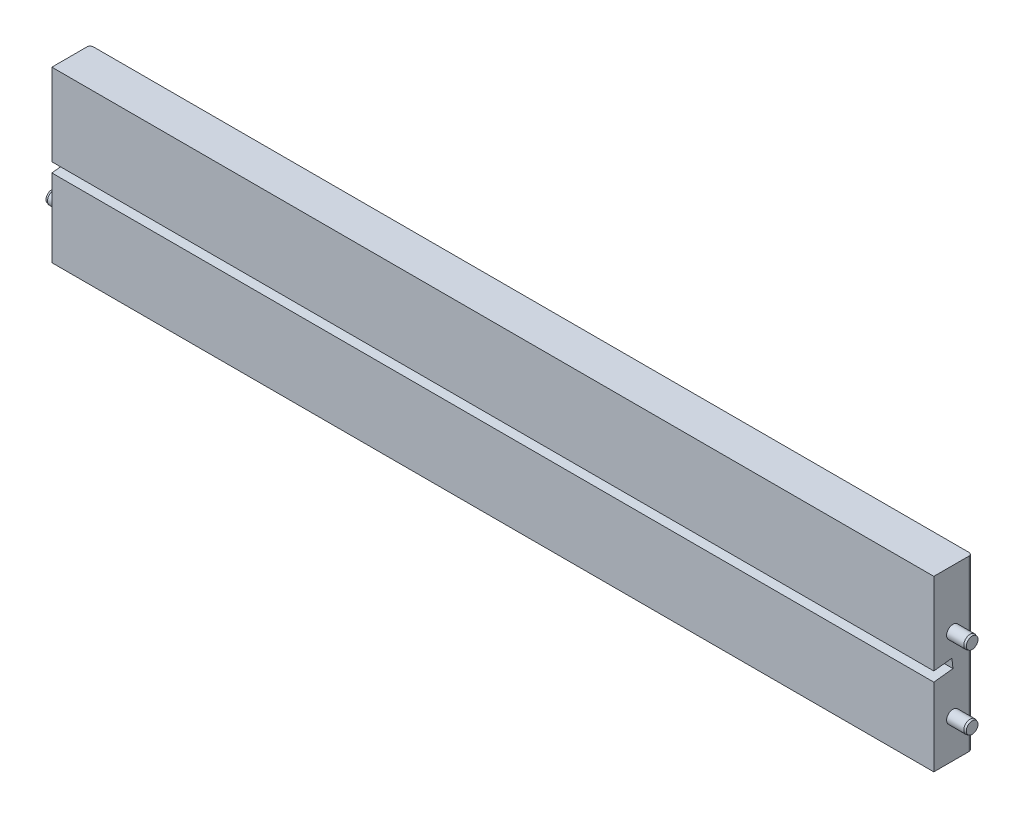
ISO-10303-21;
HEADER;
FILE_DESCRIPTION(('STEP AP214'),'2;1');
FILE_NAME('part.step','',(''),(''),'','','');
FILE_SCHEMA(('AUTOMOTIVE_DESIGN { 1 0 10303 214 1 1 1 1 }'));
ENDSEC;
DATA;
#1=APPLICATION_CONTEXT('core data for automotive mechanical design processes');
#2=APPLICATION_PROTOCOL_DEFINITION('international standard','automotive_design',2000,#1);
#3=PRODUCT_CONTEXT('',#1,'mechanical');
#4=PRODUCT('Part','Part','',(#3));
#5=PRODUCT_RELATED_PRODUCT_CATEGORY('part','',(#4));
#6=PRODUCT_DEFINITION_FORMATION('','',#4);
#7=PRODUCT_DEFINITION_CONTEXT('part definition',#1,'design');
#8=PRODUCT_DEFINITION('design','',#6,#7);
#9=PRODUCT_DEFINITION_SHAPE('','',#8);
#10=(LENGTH_UNIT() NAMED_UNIT(*) SI_UNIT(.MILLI.,.METRE.));
#11=(NAMED_UNIT(*) PLANE_ANGLE_UNIT() SI_UNIT($,.RADIAN.));
#12=(NAMED_UNIT(*) SI_UNIT($,.STERADIAN.) SOLID_ANGLE_UNIT());
#13=UNCERTAINTY_MEASURE_WITH_UNIT(LENGTH_MEASURE(1.E-05),#10,'distance_accuracy_value','');
#14=(GEOMETRIC_REPRESENTATION_CONTEXT(3) GLOBAL_UNCERTAINTY_ASSIGNED_CONTEXT((#13)) GLOBAL_UNIT_ASSIGNED_CONTEXT((#10,
#11,#12)) REPRESENTATION_CONTEXT('',''));
#15=CARTESIAN_POINT('',(0.,0.,0.));
#16=DIRECTION('',(0.,0.,1.));
#17=DIRECTION('',(1.,0.,0.));
#18=AXIS2_PLACEMENT_3D('',#15,#16,#17);
#19=CARTESIAN_POINT('',(-234.,25.8311920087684,-98.9999999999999));
#20=DIRECTION('',(1.,0.,0.));
#21=DIRECTION('',(0.,0.,-1.));
#22=AXIS2_PLACEMENT_3D('',#19,#20,#21);
#23=PLANE('',#22);
#24=CARTESIAN_POINT('',(-234.,24.,-98.9999999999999));
#25=DIRECTION('',(-1.,0.,0.));
#26=DIRECTION('',(0.,0.,1.));
#27=AXIS2_PLACEMENT_3D('',#24,#25,#26);
#28=CIRCLE('',#27,1.8311920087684);
#29=CARTESIAN_POINT('',(-234.,24.,-97.1688079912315));
#30=VERTEX_POINT('',#29);
#31=EDGE_CURVE('E57',#30,#30,#28,.T.);
#32=ORIENTED_EDGE('',*,*,#31,.T.);
#33=EDGE_LOOP('',(#32));
#34=FACE_BOUND('',#33,.T.);
#35=ADVANCED_FACE('F43',(#34),#23,.F.);
#36=CARTESIAN_POINT('',(-214.,24.,-98.9999999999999));
#37=DIRECTION('',(-1.,0.,0.));
#38=DIRECTION('',(0.,0.,1.));
#39=AXIS2_PLACEMENT_3D('',#36,#37,#38);
#40=PLANE('',#39);
#41=CARTESIAN_POINT('',(-214.,24.,-98.9999999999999));
#42=DIRECTION('',(-1.,0.,0.));
#43=DIRECTION('',(0.,0.,1.));
#44=AXIS2_PLACEMENT_3D('',#41,#42,#43);
#45=CIRCLE('',#44,1.8311920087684);
#46=CARTESIAN_POINT('',(-214.,24.,-97.1688079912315));
#47=VERTEX_POINT('',#46);
#48=EDGE_CURVE('E11',#47,#47,#45,.T.);
#49=ORIENTED_EDGE('',*,*,#48,.F.);
#50=EDGE_LOOP('',(#49));
#51=FACE_BOUND('',#50,.T.);
#52=ADVANCED_FACE('F77',(#51),#40,.F.);
#53=CARTESIAN_POINT('',(-214.,24.,-98.9999999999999));
#54=DIRECTION('',(-1.,0.,0.));
#55=DIRECTION('',(0.,0.,1.));
#56=AXIS2_PLACEMENT_3D('',#53,#54,#55);
#57=CONICAL_SURFACE('',#56,1.8311920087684,0.261799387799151);
#58=CARTESIAN_POINT('',(-214.63,24.,-98.9999999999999));
#59=DIRECTION('',(-1.,0.,0.));
#60=DIRECTION('',(0.,0.,1.));
#61=AXIS2_PLACEMENT_3D('',#58,#59,#60);
#62=CIRCLE('',#61,2.);
#63=CARTESIAN_POINT('',(-214.63,24.,-96.9999999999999));
#64=VERTEX_POINT('',#63);
#65=EDGE_CURVE('E49',#64,#64,#62,.T.);
#66=ORIENTED_EDGE('',*,*,#65,.F.);
#67=EDGE_LOOP('',(#66));
#68=FACE_BOUND('',#67,.T.);
#69=ORIENTED_EDGE('',*,*,#48,.T.);
#70=EDGE_LOOP('',(#69));
#71=FACE_BOUND('',#70,.T.);
#72=ADVANCED_FACE('F72',(#68,#71),#57,.T.);
#73=CARTESIAN_POINT('',(-240.35,24.,-98.9999999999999));
#74=DIRECTION('',(-1.,0.,0.));
#75=DIRECTION('',(0.,0.,1.));
#76=AXIS2_PLACEMENT_3D('',#73,#74,#75);
#77=CYLINDRICAL_SURFACE('',#76,2.);
#78=CARTESIAN_POINT('',(-233.37,24.,-98.9999999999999));
#79=DIRECTION('',(-1.,0.,0.));
#80=DIRECTION('',(0.,0.,1.));
#81=AXIS2_PLACEMENT_3D('',#78,#79,#80);
#82=CIRCLE('',#81,2.);
#83=CARTESIAN_POINT('',(-233.37,24.,-96.9999999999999));
#84=VERTEX_POINT('',#83);
#85=EDGE_CURVE('E53',#84,#84,#82,.T.);
#86=ORIENTED_EDGE('',*,*,#85,.F.);
#87=EDGE_LOOP('',(#86));
#88=FACE_BOUND('',#87,.T.);
#89=ORIENTED_EDGE('',*,*,#65,.T.);
#90=EDGE_LOOP('',(#89));
#91=FACE_BOUND('',#90,.T.);
#92=ADVANCED_FACE('F67',(#88,#91),#77,.T.);
#93=CARTESIAN_POINT('',(-233.37,24.,-98.9999999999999));
#94=DIRECTION('',(1.,0.,0.));
#95=DIRECTION('',(0.,0.,-1.));
#96=AXIS2_PLACEMENT_3D('',#93,#94,#95);
#97=CONICAL_SURFACE('',#96,2.,0.261799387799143);
#98=ORIENTED_EDGE('',*,*,#31,.F.);
#99=EDGE_LOOP('',(#98));
#100=FACE_BOUND('',#99,.T.);
#101=ORIENTED_EDGE('',*,*,#85,.T.);
#102=EDGE_LOOP('',(#101));
#103=FACE_BOUND('',#102,.T.);
#104=ADVANCED_FACE('F64',(#100,#103),#97,.T.);
#105=CLOSED_SHELL('',(#35,#52,#72,#92,#104));
#106=MANIFOLD_SOLID_BREP('B2',#105);
#107=CARTESIAN_POINT('',(34.,48.8311920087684,-98.9999999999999));
#108=DIRECTION('',(1.,0.,0.));
#109=DIRECTION('',(0.,0.,-1.));
#110=AXIS2_PLACEMENT_3D('',#107,#108,#109);
#111=PLANE('',#110);
#112=CARTESIAN_POINT('',(34.,47.,-98.9999999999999));
#113=DIRECTION('',(-1.,0.,0.));
#114=DIRECTION('',(0.,0.,1.));
#115=AXIS2_PLACEMENT_3D('',#112,#113,#114);
#116=CIRCLE('',#115,1.8311920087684);
#117=CARTESIAN_POINT('',(34.,47.,-97.1688079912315));
#118=VERTEX_POINT('',#117);
#119=EDGE_CURVE('E135',#118,#118,#116,.T.);
#120=ORIENTED_EDGE('',*,*,#119,.T.);
#121=EDGE_LOOP('',(#120));
#122=FACE_BOUND('',#121,.T.);
#123=ADVANCED_FACE('F121',(#122),#111,.F.);
#124=CARTESIAN_POINT('',(54.,47.,-98.9999999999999));
#125=DIRECTION('',(-1.,0.,0.));
#126=DIRECTION('',(0.,0.,1.));
#127=AXIS2_PLACEMENT_3D('',#124,#125,#126);
#128=PLANE('',#127);
#129=CARTESIAN_POINT('',(54.,47.,-98.9999999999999));
#130=DIRECTION('',(-1.,0.,0.));
#131=DIRECTION('',(0.,0.,1.));
#132=AXIS2_PLACEMENT_3D('',#129,#130,#131);
#133=CIRCLE('',#132,1.8311920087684);
#134=CARTESIAN_POINT('',(54.,47.,-97.1688079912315));
#135=VERTEX_POINT('',#134);
#136=EDGE_CURVE('E42',#135,#135,#133,.T.);
#137=ORIENTED_EDGE('',*,*,#136,.F.);
#138=EDGE_LOOP('',(#137));
#139=FACE_BOUND('',#138,.T.);
#140=ADVANCED_FACE('F155',(#139),#128,.F.);
#141=CARTESIAN_POINT('',(54.,47.,-98.9999999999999));
#142=DIRECTION('',(-1.,0.,0.));
#143=DIRECTION('',(0.,0.,1.));
#144=AXIS2_PLACEMENT_3D('',#141,#142,#143);
#145=CONICAL_SURFACE('',#144,1.8311920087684,0.261799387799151);
#146=CARTESIAN_POINT('',(53.37,47.,-98.9999999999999));
#147=DIRECTION('',(-1.,0.,0.));
#148=DIRECTION('',(0.,0.,1.));
#149=AXIS2_PLACEMENT_3D('',#146,#147,#148);
#150=CIRCLE('',#149,2.);
#151=CARTESIAN_POINT('',(53.37,47.,-96.9999999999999));
#152=VERTEX_POINT('',#151);
#153=EDGE_CURVE('E127',#152,#152,#150,.T.);
#154=ORIENTED_EDGE('',*,*,#153,.F.);
#155=EDGE_LOOP('',(#154));
#156=FACE_BOUND('',#155,.T.);
#157=ORIENTED_EDGE('',*,*,#136,.T.);
#158=EDGE_LOOP('',(#157));
#159=FACE_BOUND('',#158,.T.);
#160=ADVANCED_FACE('F150',(#156,#159),#145,.T.);
#161=CARTESIAN_POINT('',(27.65,47.,-98.9999999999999));
#162=DIRECTION('',(-1.,0.,0.));
#163=DIRECTION('',(0.,0.,1.));
#164=AXIS2_PLACEMENT_3D('',#161,#162,#163);
#165=CYLINDRICAL_SURFACE('',#164,2.);
#166=CARTESIAN_POINT('',(34.63,47.,-98.9999999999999));
#167=DIRECTION('',(-1.,0.,0.));
#168=DIRECTION('',(0.,0.,1.));
#169=AXIS2_PLACEMENT_3D('',#166,#167,#168);
#170=CIRCLE('',#169,2.);
#171=CARTESIAN_POINT('',(34.63,47.,-96.9999999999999));
#172=VERTEX_POINT('',#171);
#173=EDGE_CURVE('E131',#172,#172,#170,.T.);
#174=ORIENTED_EDGE('',*,*,#173,.F.);
#175=EDGE_LOOP('',(#174));
#176=FACE_BOUND('',#175,.T.);
#177=ORIENTED_EDGE('',*,*,#153,.T.);
#178=EDGE_LOOP('',(#177));
#179=FACE_BOUND('',#178,.T.);
#180=ADVANCED_FACE('F145',(#176,#179),#165,.T.);
#181=CARTESIAN_POINT('',(34.63,47.,-98.9999999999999));
#182=DIRECTION('',(1.,0.,0.));
#183=DIRECTION('',(0.,0.,-1.));
#184=AXIS2_PLACEMENT_3D('',#181,#182,#183);
#185=CONICAL_SURFACE('',#184,2.,0.261799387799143);
#186=ORIENTED_EDGE('',*,*,#119,.F.);
#187=EDGE_LOOP('',(#186));
#188=FACE_BOUND('',#187,.T.);
#189=ORIENTED_EDGE('',*,*,#173,.T.);
#190=EDGE_LOOP('',(#189));
#191=FACE_BOUND('',#190,.T.);
#192=ADVANCED_FACE('F142',(#188,#191),#185,.T.);
#193=CLOSED_SHELL('',(#123,#140,#160,#180,#192));
#194=MANIFOLD_SOLID_BREP('B6',#193);
#195=CARTESIAN_POINT('',(34.,25.8311920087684,-98.9999999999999));
#196=DIRECTION('',(1.,0.,0.));
#197=DIRECTION('',(0.,0.,-1.));
#198=AXIS2_PLACEMENT_3D('',#195,#196,#197);
#199=PLANE('',#198);
#200=CARTESIAN_POINT('',(34.,24.,-98.9999999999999));
#201=DIRECTION('',(-1.,0.,0.));
#202=DIRECTION('',(0.,0.,1.));
#203=AXIS2_PLACEMENT_3D('',#200,#201,#202);
#204=CIRCLE('',#203,1.8311920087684);
#205=CARTESIAN_POINT('',(34.,24.,-97.1688079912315));
#206=VERTEX_POINT('',#205);
#207=EDGE_CURVE('E214',#206,#206,#204,.T.);
#208=ORIENTED_EDGE('',*,*,#207,.T.);
#209=EDGE_LOOP('',(#208));
#210=FACE_BOUND('',#209,.T.);
#211=ADVANCED_FACE('F200',(#210),#199,.F.);
#212=CARTESIAN_POINT('',(54.,24.,-98.9999999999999));
#213=DIRECTION('',(-1.,0.,0.));
#214=DIRECTION('',(0.,0.,1.));
#215=AXIS2_PLACEMENT_3D('',#212,#213,#214);
#216=PLANE('',#215);
#217=CARTESIAN_POINT('',(54.,24.,-98.9999999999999));
#218=DIRECTION('',(-1.,0.,0.));
#219=DIRECTION('',(0.,0.,1.));
#220=AXIS2_PLACEMENT_3D('',#217,#218,#219);
#221=CIRCLE('',#220,1.8311920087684);
#222=CARTESIAN_POINT('',(54.,24.,-97.1688079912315));
#223=VERTEX_POINT('',#222);
#224=EDGE_CURVE('E120',#223,#223,#221,.T.);
#225=ORIENTED_EDGE('',*,*,#224,.F.);
#226=EDGE_LOOP('',(#225));
#227=FACE_BOUND('',#226,.T.);
#228=ADVANCED_FACE('F234',(#227),#216,.F.);
#229=CARTESIAN_POINT('',(54.,24.,-98.9999999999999));
#230=DIRECTION('',(-1.,0.,0.));
#231=DIRECTION('',(0.,0.,1.));
#232=AXIS2_PLACEMENT_3D('',#229,#230,#231);
#233=CONICAL_SURFACE('',#232,1.8311920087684,0.261799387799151);
#234=CARTESIAN_POINT('',(53.37,24.,-98.9999999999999));
#235=DIRECTION('',(-1.,0.,0.));
#236=DIRECTION('',(0.,0.,1.));
#237=AXIS2_PLACEMENT_3D('',#234,#235,#236);
#238=CIRCLE('',#237,2.);
#239=CARTESIAN_POINT('',(53.37,24.,-96.9999999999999));
#240=VERTEX_POINT('',#239);
#241=EDGE_CURVE('E206',#240,#240,#238,.T.);
#242=ORIENTED_EDGE('',*,*,#241,.F.);
#243=EDGE_LOOP('',(#242));
#244=FACE_BOUND('',#243,.T.);
#245=ORIENTED_EDGE('',*,*,#224,.T.);
#246=EDGE_LOOP('',(#245));
#247=FACE_BOUND('',#246,.T.);
#248=ADVANCED_FACE('F229',(#244,#247),#233,.T.);
#249=CARTESIAN_POINT('',(27.65,24.,-98.9999999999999));
#250=DIRECTION('',(-1.,0.,0.));
#251=DIRECTION('',(0.,0.,1.));
#252=AXIS2_PLACEMENT_3D('',#249,#250,#251);
#253=CYLINDRICAL_SURFACE('',#252,2.);
#254=CARTESIAN_POINT('',(34.63,24.,-98.9999999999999));
#255=DIRECTION('',(-1.,0.,0.));
#256=DIRECTION('',(0.,0.,1.));
#257=AXIS2_PLACEMENT_3D('',#254,#255,#256);
#258=CIRCLE('',#257,2.);
#259=CARTESIAN_POINT('',(34.63,24.,-96.9999999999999));
#260=VERTEX_POINT('',#259);
#261=EDGE_CURVE('E210',#260,#260,#258,.T.);
#262=ORIENTED_EDGE('',*,*,#261,.F.);
#263=EDGE_LOOP('',(#262));
#264=FACE_BOUND('',#263,.T.);
#265=ORIENTED_EDGE('',*,*,#241,.T.);
#266=EDGE_LOOP('',(#265));
#267=FACE_BOUND('',#266,.T.);
#268=ADVANCED_FACE('F224',(#264,#267),#253,.T.);
#269=CARTESIAN_POINT('',(34.63,24.,-98.9999999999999));
#270=DIRECTION('',(1.,0.,0.));
#271=DIRECTION('',(0.,0.,-1.));
#272=AXIS2_PLACEMENT_3D('',#269,#270,#271);
#273=CONICAL_SURFACE('',#272,2.,0.261799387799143);
#274=ORIENTED_EDGE('',*,*,#207,.F.);
#275=EDGE_LOOP('',(#274));
#276=FACE_BOUND('',#275,.T.);
#277=ORIENTED_EDGE('',*,*,#261,.T.);
#278=EDGE_LOOP('',(#277));
#279=FACE_BOUND('',#278,.T.);
#280=ADVANCED_FACE('F221',(#276,#279),#273,.T.);
#281=CLOSED_SHELL('',(#211,#228,#248,#268,#280));
#282=MANIFOLD_SOLID_BREP('B37',#281);
#283=CARTESIAN_POINT('',(48.,65.,-93.));
#284=DIRECTION('',(1.,0.,0.));
#285=DIRECTION('',(0.,0.,-1.));
#286=AXIS2_PLACEMENT_3D('',#283,#284,#285);
#287=PLANE('',#286);
#288=CARTESIAN_POINT('',(48.,47.,-98.9999999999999));
#289=DIRECTION('',(1.,0.,0.));
#290=DIRECTION('',(0.,0.,-1.));
#291=AXIS2_PLACEMENT_3D('',#288,#289,#290);
#292=CIRCLE('',#291,2.);
#293=CARTESIAN_POINT('',(48.,47.,-101.));
#294=VERTEX_POINT('',#293);
#295=EDGE_CURVE('E623',#294,#294,#292,.T.);
#296=ORIENTED_EDGE('',*,*,#295,.F.);
#297=EDGE_LOOP('',(#296));
#298=FACE_BOUND('',#297,.T.);
#299=CARTESIAN_POINT('',(48.,24.,-98.9999999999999));
#300=DIRECTION('',(1.,0.,0.));
#301=DIRECTION('',(0.,0.,-1.));
#302=AXIS2_PLACEMENT_3D('',#299,#300,#301);
#303=CIRCLE('',#302,2.);
#304=CARTESIAN_POINT('',(48.,24.,-101.));
#305=VERTEX_POINT('',#304);
#306=EDGE_CURVE('E367',#305,#305,#303,.T.);
#307=ORIENTED_EDGE('',*,*,#306,.F.);
#308=EDGE_LOOP('',(#307));
#309=FACE_BOUND('',#308,.T.);
#310=DIRECTION('',(0.,0.,-1.));
#311=VECTOR('',#310,1.);
#312=CARTESIAN_POINT('',(48.,12.,-93.));
#313=LINE('',#312,#311);
#314=CARTESIAN_POINT('',(48.,12.,-93.));
#315=VERTEX_POINT('',#314);
#316=CARTESIAN_POINT('',(48.,12.,-104.));
#317=VERTEX_POINT('',#316);
#318=EDGE_CURVE('E409',#315,#317,#313,.T.);
#319=ORIENTED_EDGE('',*,*,#318,.T.);
#320=DIRECTION('',(0.,-1.,0.));
#321=VECTOR('',#320,1.);
#322=CARTESIAN_POINT('',(48.,65.,-104.));
#323=LINE('',#322,#321);
#324=CARTESIAN_POINT('',(48.,65.,-104.));
#325=VERTEX_POINT('',#324);
#326=EDGE_CURVE('E198',#317,#325,#323,.F.);
#327=ORIENTED_EDGE('',*,*,#326,.T.);
#328=DIRECTION('',(0.,0.,-1.));
#329=VECTOR('',#328,1.);
#330=CARTESIAN_POINT('',(48.,65.,-93.));
#331=LINE('',#330,#329);
#332=CARTESIAN_POINT('',(48.,65.,-93.));
#333=VERTEX_POINT('',#332);
#334=EDGE_CURVE('E412',#333,#325,#331,.T.);
#335=ORIENTED_EDGE('',*,*,#334,.F.);
#336=DIRECTION('',(0.,-1.,0.));
#337=VECTOR('',#336,1.);
#338=CARTESIAN_POINT('',(48.,65.,-93.));
#339=LINE('',#338,#337);
#340=CARTESIAN_POINT('',(48.,39.3517950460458,-93.));
#341=VERTEX_POINT('',#340);
#342=EDGE_CURVE('E401',#333,#341,#339,.T.);
#343=ORIENTED_EDGE('',*,*,#342,.T.);
#344=DIRECTION('',(0.,-0.110431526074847,0.993883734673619));
#345=VECTOR('',#344,1.);
#346=CARTESIAN_POINT('',(48.,39.6645780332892,-95.8150468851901));
#347=LINE('',#346,#345);
#348=CARTESIAN_POINT('',(48.,39.9816512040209,-98.6687054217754));
#349=VERTEX_POINT('',#348);
#350=EDGE_CURVE('E378',#349,#341,#347,.T.);
#351=ORIENTED_EDGE('',*,*,#350,.F.);
#352=DIRECTION('',(0.,0.993883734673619,0.110431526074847));
#353=VECTOR('',#352,1.);
#354=CARTESIAN_POINT('',(48.,65.3170731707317,-95.8536585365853));
#355=LINE('',#354,#353);
#356=CARTESIAN_POINT('',(48.,37.,-98.9999999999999));
#357=VERTEX_POINT('',#356);
#358=EDGE_CURVE('E386',#357,#349,#355,.T.);
#359=ORIENTED_EDGE('',*,*,#358,.F.);
#360=DIRECTION('',(0.,-0.110431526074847,0.993883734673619));
#361=VECTOR('',#360,1.);
#362=CARTESIAN_POINT('',(48.,36.6829268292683,-96.1463414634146));
#363=LINE('',#362,#361);
#364=CARTESIAN_POINT('',(48.,36.3333333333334,-93.));
#365=VERTEX_POINT('',#364);
#366=EDGE_CURVE('E383',#357,#365,#363,.T.);
#367=ORIENTED_EDGE('',*,*,#366,.T.);
#368=EDGE_CURVE('E400',#365,#315,#339,.T.);
#369=ORIENTED_EDGE('',*,*,#368,.T.);
#370=EDGE_LOOP('',(#319,#327,#335,#343,#351,#359,#367,#369));
#371=FACE_BOUND('',#370,.T.);
#372=ADVANCED_FACE('F271',(#298,#309,#371),#287,.T.);
#373=CARTESIAN_POINT('',(-228.,12.,-92.9999999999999));
#374=DIRECTION('',(-1.,0.,0.));
#375=DIRECTION('',(0.,0.,1.));
#376=AXIS2_PLACEMENT_3D('',#373,#374,#375);
#377=PLANE('',#376);
#378=CARTESIAN_POINT('',(-228.,24.,-98.9999999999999));
#379=DIRECTION('',(-1.,0.,0.));
#380=DIRECTION('',(0.,0.,1.));
#381=AXIS2_PLACEMENT_3D('',#378,#379,#380);
#382=CIRCLE('',#381,1.99999999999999);
#383=CARTESIAN_POINT('',(-228.,24.,-96.9999999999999));
#384=VERTEX_POINT('',#383);
#385=EDGE_CURVE('E621',#384,#384,#382,.T.);
#386=ORIENTED_EDGE('',*,*,#385,.F.);
#387=EDGE_LOOP('',(#386));
#388=FACE_BOUND('',#387,.T.);
#389=CARTESIAN_POINT('',(-228.,47.,-98.9999999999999));
#390=DIRECTION('',(-1.,0.,0.));
#391=DIRECTION('',(0.,0.,1.));
#392=AXIS2_PLACEMENT_3D('',#389,#390,#391);
#393=CIRCLE('',#392,2.25);
#394=CARTESIAN_POINT('',(-228.,47.,-96.7499999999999));
#395=VERTEX_POINT('',#394);
#396=EDGE_CURVE('E360',#395,#395,#393,.T.);
#397=ORIENTED_EDGE('',*,*,#396,.F.);
#398=EDGE_LOOP('',(#397));
#399=FACE_BOUND('',#398,.T.);
#400=DIRECTION('',(0.,0.,-1.));
#401=VECTOR('',#400,1.);
#402=CARTESIAN_POINT('',(-228.,65.,-92.9999999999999));
#403=LINE('',#402,#401);
#404=CARTESIAN_POINT('',(-228.,65.,-92.9999999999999));
#405=VERTEX_POINT('',#404);
#406=CARTESIAN_POINT('',(-228.,65.,-104.));
#407=VERTEX_POINT('',#406);
#408=EDGE_CURVE('E415',#405,#407,#403,.T.);
#409=ORIENTED_EDGE('',*,*,#408,.T.);
#410=DIRECTION('',(0.,1.,0.));
#411=VECTOR('',#410,1.);
#412=CARTESIAN_POINT('',(-228.,12.,-104.));
#413=LINE('',#412,#411);
#414=CARTESIAN_POINT('',(-228.,12.,-104.));
#415=VERTEX_POINT('',#414);
#416=EDGE_CURVE('E294',#407,#415,#413,.F.);
#417=ORIENTED_EDGE('',*,*,#416,.T.);
#418=DIRECTION('',(0.,0.,-1.));
#419=VECTOR('',#418,1.);
#420=CARTESIAN_POINT('',(-228.,12.,-92.9999999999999));
#421=LINE('',#420,#419);
#422=CARTESIAN_POINT('',(-228.,12.,-92.9999999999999));
#423=VERTEX_POINT('',#422);
#424=EDGE_CURVE('E404',#423,#415,#421,.T.);
#425=ORIENTED_EDGE('',*,*,#424,.F.);
#426=DIRECTION('',(0.,1.,0.));
#427=VECTOR('',#426,1.);
#428=CARTESIAN_POINT('',(-228.,12.,-92.9999999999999));
#429=LINE('',#428,#427);
#430=CARTESIAN_POINT('',(-228.,36.3333333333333,-92.9999999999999));
#431=VERTEX_POINT('',#430);
#432=EDGE_CURVE('E394',#423,#431,#429,.T.);
#433=ORIENTED_EDGE('',*,*,#432,.T.);
#434=DIRECTION('',(0.,0.110431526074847,-0.993883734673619));
#435=VECTOR('',#434,1.);
#436=CARTESIAN_POINT('',(-228.,36.0365853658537,-90.3292682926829));
#437=LINE('',#436,#435);
#438=CARTESIAN_POINT('',(-228.,37.,-98.9999999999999));
#439=VERTEX_POINT('',#438);
#440=EDGE_CURVE('E380',#431,#439,#437,.T.);
#441=ORIENTED_EDGE('',*,*,#440,.T.);
#442=DIRECTION('',(0.,-0.993883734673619,-0.110431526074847));
#443=VECTOR('',#442,1.);
#444=CARTESIAN_POINT('',(-228.,12.9634146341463,-101.670731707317));
#445=LINE('',#444,#443);
#446=CARTESIAN_POINT('',(-228.,39.9816512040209,-98.6687054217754));
#447=VERTEX_POINT('',#446);
#448=EDGE_CURVE('E422',#447,#439,#445,.T.);
#449=ORIENTED_EDGE('',*,*,#448,.F.);
#450=DIRECTION('',(0.,0.110431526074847,-0.993883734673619));
#451=VECTOR('',#450,1.);
#452=CARTESIAN_POINT('',(-228.,39.0182365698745,-89.9979737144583));
#453=LINE('',#452,#451);
#454=CARTESIAN_POINT('',(-228.,39.3517950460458,-92.9999999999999));
#455=VERTEX_POINT('',#454);
#456=EDGE_CURVE('E374',#455,#447,#453,.T.);
#457=ORIENTED_EDGE('',*,*,#456,.F.);
#458=EDGE_CURVE('E392',#455,#405,#429,.T.);
#459=ORIENTED_EDGE('',*,*,#458,.T.);
#460=EDGE_LOOP('',(#409,#417,#425,#433,#441,#449,#457,#459));
#461=FACE_BOUND('',#460,.T.);
#462=ADVANCED_FACE('F448',(#388,#399,#461),#377,.T.);
#463=CARTESIAN_POINT('',(0.,0.,-93.));
#464=DIRECTION('',(0.,0.,-1.));
#465=DIRECTION('',(-1.,0.,0.));
#466=AXIS2_PLACEMENT_3D('',#463,#464,#465);
#467=PLANE('',#466);
#468=DIRECTION('',(1.,0.,0.));
#469=VECTOR('',#468,1.);
#470=CARTESIAN_POINT('',(0.,36.3333333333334,-93.));
#471=LINE('',#470,#469);
#472=EDGE_CURVE('E420',#431,#365,#471,.T.);
#473=ORIENTED_EDGE('',*,*,#472,.F.);
#474=ORIENTED_EDGE('',*,*,#432,.F.);
#475=DIRECTION('',(-1.,0.,0.));
#476=VECTOR('',#475,1.);
#477=CARTESIAN_POINT('',(48.,12.,-93.));
#478=LINE('',#477,#476);
#479=EDGE_CURVE('E389',#315,#423,#478,.T.);
#480=ORIENTED_EDGE('',*,*,#479,.F.);
#481=ORIENTED_EDGE('',*,*,#368,.F.);
#482=EDGE_LOOP('',(#473,#474,#480,#481));
#483=FACE_BOUND('',#482,.T.);
#484=ADVANCED_FACE('F464',(#483),#467,.F.);
#485=CARTESIAN_POINT('',(48.,12.,-93.));
#486=DIRECTION('',(0.,-1.,0.));
#487=DIRECTION('',(0.,0.,-1.));
#488=AXIS2_PLACEMENT_3D('',#485,#486,#487);
#489=PLANE('',#488);
#490=ORIENTED_EDGE('',*,*,#424,.T.);
#491=CARTESIAN_POINT('',(-227.,12.,-104.));
#492=DIRECTION('',(0.,-1.,0.));
#493=DIRECTION('',(0.,0.,-1.));
#494=AXIS2_PLACEMENT_3D('',#491,#492,#493);
#495=CIRCLE('',#494,1.);
#496=CARTESIAN_POINT('',(-227.,12.,-105.));
#497=VERTEX_POINT('',#496);
#498=EDGE_CURVE('E279',#415,#497,#495,.T.);
#499=ORIENTED_EDGE('',*,*,#498,.T.);
#500=DIRECTION('',(-1.,0.,0.));
#501=VECTOR('',#500,1.);
#502=CARTESIAN_POINT('',(48.,12.,-105.));
#503=LINE('',#502,#501);
#504=CARTESIAN_POINT('',(47.,12.,-105.));
#505=VERTEX_POINT('',#504);
#506=EDGE_CURVE('E388',#505,#497,#503,.T.);
#507=ORIENTED_EDGE('',*,*,#506,.F.);
#508=CARTESIAN_POINT('',(47.,12.,-104.));
#509=DIRECTION('',(0.,-1.,0.));
#510=DIRECTION('',(0.,0.,-1.));
#511=AXIS2_PLACEMENT_3D('',#508,#509,#510);
#512=CIRCLE('',#511,1.);
#513=EDGE_CURVE('E286',#505,#317,#512,.T.);
#514=ORIENTED_EDGE('',*,*,#513,.T.);
#515=ORIENTED_EDGE('',*,*,#318,.F.);
#516=ORIENTED_EDGE('',*,*,#479,.T.);
#517=EDGE_LOOP('',(#490,#499,#507,#514,#515,#516));
#518=FACE_BOUND('',#517,.T.);
#519=ADVANCED_FACE('F436',(#518),#489,.T.);
#520=CARTESIAN_POINT('',(-228.,65.,-92.9999999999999));
#521=DIRECTION('',(0.,1.,0.));
#522=DIRECTION('',(0.,0.,1.));
#523=AXIS2_PLACEMENT_3D('',#520,#521,#522);
#524=PLANE('',#523);
#525=DIRECTION('',(1.,0.,0.));
#526=VECTOR('',#525,1.);
#527=CARTESIAN_POINT('',(-228.,65.,-105.));
#528=LINE('',#527,#526);
#529=CARTESIAN_POINT('',(-227.,65.,-105.));
#530=VERTEX_POINT('',#529);
#531=CARTESIAN_POINT('',(47.,65.,-105.));
#532=VERTEX_POINT('',#531);
#533=EDGE_CURVE('E393',#530,#532,#528,.T.);
#534=ORIENTED_EDGE('',*,*,#533,.F.);
#535=CARTESIAN_POINT('',(-227.,65.,-104.));
#536=DIRECTION('',(0.,1.,0.));
#537=DIRECTION('',(0.,0.,1.));
#538=AXIS2_PLACEMENT_3D('',#535,#536,#537);
#539=CIRCLE('',#538,1.);
#540=EDGE_CURVE('E432',#530,#407,#539,.T.);
#541=ORIENTED_EDGE('',*,*,#540,.T.);
#542=ORIENTED_EDGE('',*,*,#408,.F.);
#543=DIRECTION('',(1.,0.,0.));
#544=VECTOR('',#543,1.);
#545=CARTESIAN_POINT('',(-228.,65.,-92.9999999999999));
#546=LINE('',#545,#544);
#547=EDGE_CURVE('E397',#405,#333,#546,.T.);
#548=ORIENTED_EDGE('',*,*,#547,.T.);
#549=ORIENTED_EDGE('',*,*,#334,.T.);
#550=CARTESIAN_POINT('',(47.,65.,-104.));
#551=DIRECTION('',(0.,1.,0.));
#552=DIRECTION('',(0.,0.,1.));
#553=AXIS2_PLACEMENT_3D('',#550,#551,#552);
#554=CIRCLE('',#553,1.);
#555=EDGE_CURVE('E430',#325,#532,#554,.T.);
#556=ORIENTED_EDGE('',*,*,#555,.T.);
#557=EDGE_LOOP('',(#534,#541,#542,#548,#549,#556));
#558=FACE_BOUND('',#557,.T.);
#559=ADVANCED_FACE('F446',(#558),#524,.T.);
#560=ORIENTED_EDGE('',*,*,#458,.F.);
#561=DIRECTION('',(1.,0.,0.));
#562=VECTOR('',#561,1.);
#563=CARTESIAN_POINT('',(0.,39.3517950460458,-93.));
#564=LINE('',#563,#562);
#565=EDGE_CURVE('E411',#455,#341,#564,.T.);
#566=ORIENTED_EDGE('',*,*,#565,.T.);
#567=ORIENTED_EDGE('',*,*,#342,.F.);
#568=ORIENTED_EDGE('',*,*,#547,.F.);
#569=EDGE_LOOP('',(#560,#566,#567,#568));
#570=FACE_BOUND('',#569,.T.);
#571=ADVANCED_FACE('F453',(#570),#467,.F.);
#572=CARTESIAN_POINT('',(0.,0.,-105.));
#573=DIRECTION('',(0.,0.,-1.));
#574=DIRECTION('',(-1.,0.,0.));
#575=AXIS2_PLACEMENT_3D('',#572,#573,#574);
#576=PLANE('',#575);
#577=ORIENTED_EDGE('',*,*,#506,.T.);
#578=DIRECTION('',(0.,1.,0.));
#579=VECTOR('',#578,1.);
#580=CARTESIAN_POINT('',(-227.,0.,-105.));
#581=LINE('',#580,#579);
#582=EDGE_CURVE('E427',#497,#530,#581,.T.);
#583=ORIENTED_EDGE('',*,*,#582,.T.);
#584=ORIENTED_EDGE('',*,*,#533,.T.);
#585=DIRECTION('',(0.,-1.,0.));
#586=VECTOR('',#585,1.);
#587=CARTESIAN_POINT('',(47.,0.,-105.));
#588=LINE('',#587,#586);
#589=EDGE_CURVE('E423',#532,#505,#588,.T.);
#590=ORIENTED_EDGE('',*,*,#589,.T.);
#591=EDGE_LOOP('',(#577,#583,#584,#590));
#592=FACE_BOUND('',#591,.T.);
#593=ADVANCED_FACE('F440',(#592),#576,.T.);
#594=CARTESIAN_POINT('',(51.,37.,-98.9999999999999));
#595=DIRECTION('',(0.,0.110431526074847,-0.993883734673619));
#596=DIRECTION('',(0.,0.993883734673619,0.110431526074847));
#597=AXIS2_PLACEMENT_3D('',#594,#595,#596);
#598=PLANE('',#597);
#599=ORIENTED_EDGE('',*,*,#358,.T.);
#600=DIRECTION('',(-1.,0.,0.));
#601=VECTOR('',#600,1.);
#602=CARTESIAN_POINT('',(51.,39.9816512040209,-98.6687054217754));
#603=LINE('',#602,#601);
#604=EDGE_CURVE('E364',#349,#447,#603,.T.);
#605=ORIENTED_EDGE('',*,*,#604,.T.);
#606=ORIENTED_EDGE('',*,*,#448,.T.);
#607=DIRECTION('',(-1.,0.,0.));
#608=VECTOR('',#607,1.);
#609=CARTESIAN_POINT('',(51.,37.,-98.9999999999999));
#610=LINE('',#609,#608);
#611=EDGE_CURVE('E371',#357,#439,#610,.T.);
#612=ORIENTED_EDGE('',*,*,#611,.F.);
#613=EDGE_LOOP('',(#599,#605,#606,#612));
#614=FACE_BOUND('',#613,.T.);
#615=ADVANCED_FACE('F470',(#614),#598,.F.);
#616=CARTESIAN_POINT('',(0.,25.6829268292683,2.85365853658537));
#617=DIRECTION('',(0.,0.993883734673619,0.110431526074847));
#618=DIRECTION('',(0.,-0.110431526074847,0.993883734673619));
#619=AXIS2_PLACEMENT_3D('',#616,#617,#618);
#620=PLANE('',#619);
#621=ORIENTED_EDGE('',*,*,#611,.T.);
#622=ORIENTED_EDGE('',*,*,#440,.F.);
#623=ORIENTED_EDGE('',*,*,#472,.T.);
#624=ORIENTED_EDGE('',*,*,#366,.F.);
#625=EDGE_LOOP('',(#621,#622,#623,#624));
#626=FACE_BOUND('',#625,.T.);
#627=ADVANCED_FACE('F466',(#626),#620,.T.);
#628=CARTESIAN_POINT('',(0.,28.6645780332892,3.18495311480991));
#629=DIRECTION('',(0.,0.993883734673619,0.110431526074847));
#630=DIRECTION('',(0.,-0.110431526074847,0.993883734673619));
#631=AXIS2_PLACEMENT_3D('',#628,#629,#630);
#632=PLANE('',#631);
#633=ORIENTED_EDGE('',*,*,#350,.T.);
#634=ORIENTED_EDGE('',*,*,#565,.F.);
#635=ORIENTED_EDGE('',*,*,#456,.T.);
#636=ORIENTED_EDGE('',*,*,#604,.F.);
#637=EDGE_LOOP('',(#633,#634,#635,#636));
#638=FACE_BOUND('',#637,.T.);
#639=ADVANCED_FACE('F354',(#638),#632,.F.);
#640=CARTESIAN_POINT('',(-211.351936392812,47.,-98.9999999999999));
#641=DIRECTION('',(-1.,0.,0.));
#642=DIRECTION('',(0.,0.,1.));
#643=AXIS2_PLACEMENT_3D('',#640,#641,#642);
#644=CONICAL_SURFACE('',#643,2.25,1.02974425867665);
#645=CARTESIAN_POINT('',(-210.,47.,-98.9999999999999));
#646=VERTEX_POINT('',#645);
#647=VERTEX_LOOP('',#646);
#648=FACE_BOUND('',#647,.T.);
#649=CARTESIAN_POINT('',(-211.351936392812,47.,-98.9999999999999));
#650=DIRECTION('',(-1.,0.,0.));
#651=DIRECTION('',(0.,0.,1.));
#652=AXIS2_PLACEMENT_3D('',#649,#650,#651);
#653=CIRCLE('',#652,2.25);
#654=CARTESIAN_POINT('',(-211.351936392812,47.,-96.7499999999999));
#655=VERTEX_POINT('',#654);
#656=EDGE_CURVE('E358',#655,#655,#653,.T.);
#657=ORIENTED_EDGE('',*,*,#656,.T.);
#658=EDGE_LOOP('',(#657));
#659=FACE_BOUND('',#658,.T.);
#660=ADVANCED_FACE('F350',(#648,#659),#644,.F.);
#661=CARTESIAN_POINT('',(-240.,47.,-98.9999999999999));
#662=DIRECTION('',(-1.,0.,0.));
#663=DIRECTION('',(0.,0.,1.));
#664=AXIS2_PLACEMENT_3D('',#661,#662,#663);
#665=CYLINDRICAL_SURFACE('',#664,2.25);
#666=ORIENTED_EDGE('',*,*,#396,.T.);
#667=EDGE_LOOP('',(#666));
#668=FACE_BOUND('',#667,.T.);
#669=ORIENTED_EDGE('',*,*,#656,.F.);
#670=EDGE_LOOP('',(#669));
#671=FACE_BOUND('',#670,.T.);
#672=ADVANCED_FACE('F353',(#668,#671),#665,.F.);
#673=CARTESIAN_POINT('',(34.,24.,-98.9999999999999));
#674=DIRECTION('',(-1.,0.,0.));
#675=DIRECTION('',(0.,0.,1.));
#676=AXIS2_PLACEMENT_3D('',#673,#674,#675);
#677=PLANE('',#676);
#678=CARTESIAN_POINT('',(34.,24.,-98.9999999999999));
#679=DIRECTION('',(1.,0.,0.));
#680=DIRECTION('',(0.,0.,-1.));
#681=AXIS2_PLACEMENT_3D('',#678,#679,#680);
#682=CIRCLE('',#681,1.99999999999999);
#683=CARTESIAN_POINT('',(34.,24.,-101.));
#684=VERTEX_POINT('',#683);
#685=EDGE_CURVE('E361',#684,#684,#682,.T.);
#686=ORIENTED_EDGE('',*,*,#685,.T.);
#687=EDGE_LOOP('',(#686));
#688=FACE_BOUND('',#687,.T.);
#689=ADVANCED_FACE('F520',(#688),#677,.F.);
#690=CARTESIAN_POINT('',(48.,24.,-98.9999999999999));
#691=DIRECTION('',(1.,0.,0.));
#692=DIRECTION('',(0.,0.,-1.));
#693=AXIS2_PLACEMENT_3D('',#690,#691,#692);
#694=CYLINDRICAL_SURFACE('',#693,2.);
#695=ORIENTED_EDGE('',*,*,#685,.F.);
#696=EDGE_LOOP('',(#695));
#697=FACE_BOUND('',#696,.T.);
#698=ORIENTED_EDGE('',*,*,#306,.T.);
#699=EDGE_LOOP('',(#698));
#700=FACE_BOUND('',#699,.T.);
#701=ADVANCED_FACE('F510',(#697,#700),#694,.F.);
#702=CARTESIAN_POINT('',(34.,47.,-98.9999999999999));
#703=DIRECTION('',(-1.,0.,0.));
#704=DIRECTION('',(0.,0.,1.));
#705=AXIS2_PLACEMENT_3D('',#702,#703,#704);
#706=PLANE('',#705);
#707=CARTESIAN_POINT('',(34.,47.,-98.9999999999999));
#708=DIRECTION('',(1.,0.,0.));
#709=DIRECTION('',(0.,0.,-1.));
#710=AXIS2_PLACEMENT_3D('',#707,#708,#709);
#711=CIRCLE('',#710,1.99999999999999);
#712=CARTESIAN_POINT('',(34.,47.,-101.));
#713=VERTEX_POINT('',#712);
#714=EDGE_CURVE('E628',#713,#713,#711,.T.);
#715=ORIENTED_EDGE('',*,*,#714,.T.);
#716=EDGE_LOOP('',(#715));
#717=FACE_BOUND('',#716,.T.);
#718=ADVANCED_FACE('F504',(#717),#706,.F.);
#719=CARTESIAN_POINT('',(48.,47.,-98.9999999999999));
#720=DIRECTION('',(1.,0.,0.));
#721=DIRECTION('',(0.,0.,-1.));
#722=AXIS2_PLACEMENT_3D('',#719,#720,#721);
#723=CYLINDRICAL_SURFACE('',#722,2.);
#724=ORIENTED_EDGE('',*,*,#714,.F.);
#725=EDGE_LOOP('',(#724));
#726=FACE_BOUND('',#725,.T.);
#727=ORIENTED_EDGE('',*,*,#295,.T.);
#728=EDGE_LOOP('',(#727));
#729=FACE_BOUND('',#728,.T.);
#730=ADVANCED_FACE('F498',(#726,#729),#723,.F.);
#731=CARTESIAN_POINT('',(-227.,0.,-104.));
#732=DIRECTION('',(0.,1.,0.));
#733=DIRECTION('',(0.,0.,1.));
#734=AXIS2_PLACEMENT_3D('',#731,#732,#733);
#735=CYLINDRICAL_SURFACE('',#734,1.);
#736=ORIENTED_EDGE('',*,*,#498,.F.);
#737=ORIENTED_EDGE('',*,*,#416,.F.);
#738=ORIENTED_EDGE('',*,*,#540,.F.);
#739=ORIENTED_EDGE('',*,*,#582,.F.);
#740=EDGE_LOOP('',(#736,#737,#738,#739));
#741=FACE_BOUND('',#740,.T.);
#742=ADVANCED_FACE('F443',(#741),#735,.T.);
#743=CARTESIAN_POINT('',(47.,0.,-104.));
#744=DIRECTION('',(0.,-1.,0.));
#745=DIRECTION('',(0.,0.,-1.));
#746=AXIS2_PLACEMENT_3D('',#743,#744,#745);
#747=CYLINDRICAL_SURFACE('',#746,1.);
#748=ORIENTED_EDGE('',*,*,#555,.F.);
#749=ORIENTED_EDGE('',*,*,#326,.F.);
#750=ORIENTED_EDGE('',*,*,#513,.F.);
#751=ORIENTED_EDGE('',*,*,#589,.F.);
#752=EDGE_LOOP('',(#748,#749,#750,#751));
#753=FACE_BOUND('',#752,.T.);
#754=ADVANCED_FACE('F273',(#753),#747,.T.);
#755=CARTESIAN_POINT('',(-214.,24.,-98.9999999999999));
#756=DIRECTION('',(1.,0.,0.));
#757=DIRECTION('',(0.,0.,-1.));
#758=AXIS2_PLACEMENT_3D('',#755,#756,#757);
#759=PLANE('',#758);
#760=CARTESIAN_POINT('',(-214.,24.,-98.9999999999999));
#761=DIRECTION('',(-1.,0.,0.));
#762=DIRECTION('',(0.,0.,1.));
#763=AXIS2_PLACEMENT_3D('',#760,#761,#762);
#764=CIRCLE('',#763,1.99999999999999);
#765=CARTESIAN_POINT('',(-214.,24.,-96.9999999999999));
#766=VERTEX_POINT('',#765);
#767=EDGE_CURVE('E618',#766,#766,#764,.T.);
#768=ORIENTED_EDGE('',*,*,#767,.T.);
#769=EDGE_LOOP('',(#768));
#770=FACE_BOUND('',#769,.T.);
#771=ADVANCED_FACE('F503',(#770),#759,.F.);
#772=CARTESIAN_POINT('',(-228.,24.,-98.9999999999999));
#773=DIRECTION('',(-1.,0.,0.));
#774=DIRECTION('',(0.,0.,1.));
#775=AXIS2_PLACEMENT_3D('',#772,#773,#774);
#776=CYLINDRICAL_SURFACE('',#775,1.99999999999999);
#777=ORIENTED_EDGE('',*,*,#767,.F.);
#778=EDGE_LOOP('',(#777));
#779=FACE_BOUND('',#778,.T.);
#780=ORIENTED_EDGE('',*,*,#385,.T.);
#781=EDGE_LOOP('',(#780));
#782=FACE_BOUND('',#781,.T.);
#783=ADVANCED_FACE('F603',(#779,#782),#776,.F.);
#784=CLOSED_SHELL('',(#372,#462,#484,#519,#559,#571,#593,#615,#627,#639,#660,#672,#689,#701,
#718,#730,#742,#754,#771,#783));
#785=MANIFOLD_SOLID_BREP('B115',#784);
#786=ADVANCED_BREP_SHAPE_REPRESENTATION('',(#18,#106,#194,#282,#785),#14);
#787=SHAPE_DEFINITION_REPRESENTATION(#9,#786);
ENDSEC;
END-ISO-10303-21;
